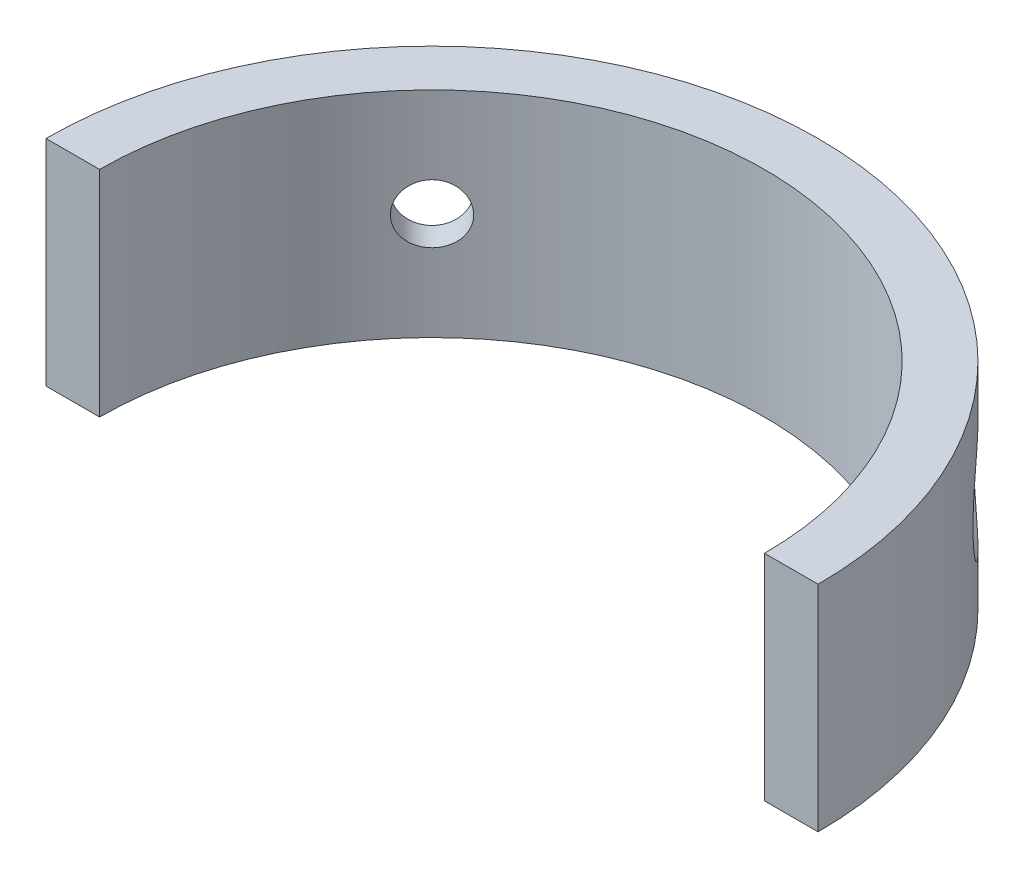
ISO-10303-21;
HEADER;
FILE_DESCRIPTION(('STEP AP214'),'2;1');
FILE_NAME('part.step','',(''),(''),'','','');
FILE_SCHEMA(('AUTOMOTIVE_DESIGN { 1 0 10303 214 1 1 1 1 }'));
ENDSEC;
DATA;
#1=APPLICATION_CONTEXT('core data for automotive mechanical design processes');
#2=APPLICATION_PROTOCOL_DEFINITION('international standard','automotive_design',2000,#1);
#3=PRODUCT_CONTEXT('',#1,'mechanical');
#4=PRODUCT('Part','Part','',(#3));
#5=PRODUCT_RELATED_PRODUCT_CATEGORY('part','',(#4));
#6=PRODUCT_DEFINITION_FORMATION('','',#4);
#7=PRODUCT_DEFINITION_CONTEXT('part definition',#1,'design');
#8=PRODUCT_DEFINITION('design','',#6,#7);
#9=PRODUCT_DEFINITION_SHAPE('','',#8);
#10=(LENGTH_UNIT() NAMED_UNIT(*) SI_UNIT(.MILLI.,.METRE.));
#11=(NAMED_UNIT(*) PLANE_ANGLE_UNIT() SI_UNIT($,.RADIAN.));
#12=(NAMED_UNIT(*) SI_UNIT($,.STERADIAN.) SOLID_ANGLE_UNIT());
#13=UNCERTAINTY_MEASURE_WITH_UNIT(LENGTH_MEASURE(1.E-05),#10,'distance_accuracy_value','');
#14=(GEOMETRIC_REPRESENTATION_CONTEXT(3) GLOBAL_UNCERTAINTY_ASSIGNED_CONTEXT((#13)) GLOBAL_UNIT_ASSIGNED_CONTEXT((#10,
#11,#12)) REPRESENTATION_CONTEXT('',''));
#15=CARTESIAN_POINT('',(0.,0.,0.));
#16=DIRECTION('',(0.,0.,1.));
#17=DIRECTION('',(1.,0.,0.));
#18=AXIS2_PLACEMENT_3D('',#15,#16,#17);
#19=CARTESIAN_POINT('',(0.,20.,0.));
#20=DIRECTION('',(0.,-1.,0.));
#21=DIRECTION('',(0.,0.,-1.));
#22=AXIS2_PLACEMENT_3D('',#19,#20,#21);
#23=CYLINDRICAL_SURFACE('',#22,31.);
#24=CARTESIAN_POINT('',(19.8893462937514,10.,-23.7784335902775));
#25=CARTESIAN_POINT('',(19.8893521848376,10.1541422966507,-23.778429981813));
#26=CARTESIAN_POINT('',(19.8993661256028,10.3083886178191,-23.7700636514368));
#27=CARTESIAN_POINT('',(19.939097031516,10.6126108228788,-23.736744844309));
#28=CARTESIAN_POINT('',(19.9688361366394,10.7625817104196,-23.711773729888));
#29=CARTESIAN_POINT('',(20.0469462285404,11.0538030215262,-23.645772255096));
#30=CARTESIAN_POINT('',(20.0953064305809,11.1950584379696,-23.6047511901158));
#31=CARTESIAN_POINT('',(20.2089574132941,11.46492316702,-23.5075223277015));
#32=CARTESIAN_POINT('',(20.274244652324,11.5935351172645,-23.4513177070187));
#33=CARTESIAN_POINT('',(20.4197177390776,11.8348665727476,-23.324759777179));
#34=CARTESIAN_POINT('',(20.4999413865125,11.9475444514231,-23.254370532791));
#35=CARTESIAN_POINT('',(20.6725087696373,12.1534513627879,-23.1010967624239));
#36=CARTESIAN_POINT('',(20.7648530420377,12.2466795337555,-23.0182116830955));
#37=CARTESIAN_POINT('',(20.9588279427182,12.4111810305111,-22.8417321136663));
#38=CARTESIAN_POINT('',(21.0604735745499,12.482418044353,-22.7481202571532));
#39=CARTESIAN_POINT('',(21.2697044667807,12.6006827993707,-22.5526085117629));
#40=CARTESIAN_POINT('',(21.3772896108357,12.6477110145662,-22.4507087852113));
#41=CARTESIAN_POINT('',(21.5948048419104,12.7161025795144,-22.2415623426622));
#42=CARTESIAN_POINT('',(21.7047279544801,12.7375336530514,-22.1343305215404));
#43=CARTESIAN_POINT('',(21.9239451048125,12.7543320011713,-21.9172175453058));
#44=CARTESIAN_POINT('',(22.0332391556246,12.7496998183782,-21.8073364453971));
#45=CARTESIAN_POINT('',(22.2477989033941,12.7145584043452,-21.5883968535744));
#46=CARTESIAN_POINT('',(22.3530750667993,12.6841219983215,-21.4793369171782));
#47=CARTESIAN_POINT('',(22.5571030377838,12.5983494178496,-21.2649715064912));
#48=CARTESIAN_POINT('',(22.6558547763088,12.5430129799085,-21.1596660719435));
#49=CARTESIAN_POINT('',(22.8444618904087,12.4089303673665,-20.9559032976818));
#50=CARTESIAN_POINT('',(22.9343046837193,12.3301516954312,-20.8574557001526));
#51=CARTESIAN_POINT('',(23.102782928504,12.1514444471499,-20.6706861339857));
#52=CARTESIAN_POINT('',(23.1814181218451,12.0515153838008,-20.5823643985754));
#53=CARTESIAN_POINT('',(23.3259371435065,11.8329337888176,-20.4184393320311));
#54=CARTESIAN_POINT('',(23.391776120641,11.7142179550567,-20.3428808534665));
#55=CARTESIAN_POINT('',(23.5089135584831,11.4616529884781,-20.2074003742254));
#56=CARTESIAN_POINT('',(23.5602120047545,11.3278038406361,-20.1474783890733));
#57=CARTESIAN_POINT('',(23.6471760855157,11.0487259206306,-20.0453382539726));
#58=CARTESIAN_POINT('',(23.682839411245,10.9034954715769,-20.0031227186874));
#59=CARTESIAN_POINT('',(23.737768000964,10.6057996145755,-19.937908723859));
#60=CARTESIAN_POINT('',(23.7570336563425,10.4533343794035,-19.9149098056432));
#61=CARTESIAN_POINT('',(23.7787269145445,10.1460524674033,-19.8890029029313));
#62=CARTESIAN_POINT('',(23.7812116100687,9.99124556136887,-19.8860267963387));
#63=CARTESIAN_POINT('',(23.769442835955,9.68318672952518,-19.900092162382));
#64=CARTESIAN_POINT('',(23.7551895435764,9.52993478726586,-19.9171334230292));
#65=CARTESIAN_POINT('',(23.7102791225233,9.22959150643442,-19.970575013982));
#66=CARTESIAN_POINT('',(23.6796489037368,9.08249048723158,-20.0069435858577));
#67=CARTESIAN_POINT('',(23.6026401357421,8.79832452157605,-20.0977337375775));
#68=CARTESIAN_POINT('',(23.5562613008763,8.66125975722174,-20.1521556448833));
#69=CARTESIAN_POINT('',(23.4485882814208,8.40065238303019,-20.2773399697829));
#70=CARTESIAN_POINT('',(23.3872543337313,8.27714711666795,-20.3481459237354));
#71=CARTESIAN_POINT('',(23.2510666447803,8.0475424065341,-20.5036229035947));
#72=CARTESIAN_POINT('',(23.1762126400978,7.94144330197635,-20.5882941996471));
#73=CARTESIAN_POINT('',(23.014441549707,7.74935951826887,-20.7689719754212));
#74=CARTESIAN_POINT('',(22.9274910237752,7.66343243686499,-20.8650097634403));
#75=CARTESIAN_POINT('',(22.7437576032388,7.51452739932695,-21.065135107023));
#76=CARTESIAN_POINT('',(22.646974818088,7.45154918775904,-21.1692225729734));
#77=CARTESIAN_POINT('',(22.4461562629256,7.35042812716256,-21.382035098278));
#78=CARTESIAN_POINT('',(22.342131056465,7.31224991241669,-21.4907533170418));
#79=CARTESIAN_POINT('',(22.1294714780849,7.26169704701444,-21.7096699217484));
#80=CARTESIAN_POINT('',(22.0208372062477,7.24932183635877,-21.8198682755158));
#81=CARTESIAN_POINT('',(21.8023783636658,7.25073319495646,-22.0381501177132));
#82=CARTESIAN_POINT('',(21.6925591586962,7.26443010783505,-22.1462395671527));
#83=CARTESIAN_POINT('',(21.4745572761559,7.31740962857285,-22.3576935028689));
#84=CARTESIAN_POINT('',(21.3663746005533,7.35669226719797,-22.4610579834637));
#85=CARTESIAN_POINT('',(21.1549158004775,7.45970471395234,-22.6603323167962));
#86=CARTESIAN_POINT('',(21.0516392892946,7.52343259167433,-22.7562427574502));
#87=CARTESIAN_POINT('',(20.8531920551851,7.6735165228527,-22.938232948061));
#88=CARTESIAN_POINT('',(20.7580212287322,7.75987228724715,-23.0243128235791));
#89=CARTESIAN_POINT('',(20.5785244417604,7.95309736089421,-23.1848853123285));
#90=CARTESIAN_POINT('',(20.4942351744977,8.06003319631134,-23.2593388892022));
#91=CARTESIAN_POINT('',(20.3396337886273,8.29125841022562,-23.3946549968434));
#92=CARTESIAN_POINT('',(20.2693250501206,8.4155519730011,-23.4555142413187));
#93=CARTESIAN_POINT('',(20.1449692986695,8.6782368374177,-23.5624058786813));
#94=CARTESIAN_POINT('',(20.0909562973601,8.81665682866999,-23.6084072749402));
#95=CARTESIAN_POINT('',(20.0013287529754,9.10336443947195,-23.6843900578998));
#96=CARTESIAN_POINT('',(19.9656931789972,9.25164055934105,-23.7143897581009));
#97=CARTESIAN_POINT('',(19.9230971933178,9.50065086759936,-23.7501715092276));
#98=CARTESIAN_POINT('',(19.910460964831,9.59978630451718,-23.7607589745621));
#99=CARTESIAN_POINT('',(19.8935836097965,9.79926645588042,-23.7748911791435));
#100=CARTESIAN_POINT('',(19.8893424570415,9.89961116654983,-23.7784359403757));
#101=CARTESIAN_POINT('',(19.8893462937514,10.,-23.7784335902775));
#102=B_SPLINE_CURVE_WITH_KNOTS('',3,(#24,#25,#26,#27,#28,#29,#30,#31,#32,#33,#34,#35,#36,#37,
#38,#39,#40,#41,#42,#43,#44,#45,#46,#47,#48,#49,#50,#51,#52,#53,#54,#55,#56,#57,#58,#59,#60,#61,
#62,#63,#64,#65,#66,#67,#68,#69,#70,#71,#72,#73,#74,#75,#76,#77,#78,#79,#80,#81,#82,#83,#84,#85,
#86,#87,#88,#89,#90,#91,#92,#93,#94,#95,#96,#97,#98,#99,#100,#101),.UNSPECIFIED.,.T.,.F.,(4,2,2,
2,2,2,2,2,2,2,2,2,2,2,2,2,2,2,2,2,2,2,2,2,2,2,2,2,2,2,2,2,2,2,2,2,2,2,4),(0.,0.46206033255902,
0.924640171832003,1.3869525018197,1.84916818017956,2.31256989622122,2.77599213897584,
3.24017554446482,3.70434986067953,4.16729334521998,4.63022719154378,5.09185886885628,
5.55349543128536,6.01577495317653,6.47806512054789,6.94194751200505,7.40583036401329,
7.86978169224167,8.33372194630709,8.79608296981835,9.2584390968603,9.7200378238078,
10.1816449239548,10.6444930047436,11.1073501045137,11.5715131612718,12.0356710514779,
12.49916557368,12.962650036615,13.4245435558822,13.8864376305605,14.348295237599,
14.8101469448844,15.2735174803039,15.7369999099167,16.2014431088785,16.6653536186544,
16.9662823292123,17.2672101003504),.UNSPECIFIED.);
#103=CARTESIAN_POINT('',(19.8893462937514,10.,-23.7784335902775));
#104=VERTEX_POINT('',#103);
#105=EDGE_CURVE('E38',#104,#104,#102,.T.);
#106=ORIENTED_EDGE('',*,*,#105,.T.);
#107=EDGE_LOOP('',(#106));
#108=FACE_BOUND('',#107,.T.);
#109=CARTESIAN_POINT('',(-23.7784335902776,10.,-19.8893462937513));
#110=CARTESIAN_POINT('',(-23.7784299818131,10.1541422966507,-19.8893521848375));
#111=CARTESIAN_POINT('',(-23.7700636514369,10.3083886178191,-19.8993661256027));
#112=CARTESIAN_POINT('',(-23.736744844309,10.6126108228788,-19.9390970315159));
#113=CARTESIAN_POINT('',(-23.7117737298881,10.7625817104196,-19.9688361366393));
#114=CARTESIAN_POINT('',(-23.645772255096,11.0538030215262,-20.0469462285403));
#115=CARTESIAN_POINT('',(-23.6047511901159,11.1950584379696,-20.0953064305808));
#116=CARTESIAN_POINT('',(-23.5075223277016,11.46492316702,-20.208957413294));
#117=CARTESIAN_POINT('',(-23.4513177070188,11.5935351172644,-20.274244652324));
#118=CARTESIAN_POINT('',(-23.324759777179,11.8348665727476,-20.4197177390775));
#119=CARTESIAN_POINT('',(-23.254370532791,11.9475444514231,-20.4999413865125));
#120=CARTESIAN_POINT('',(-23.101096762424,12.1534513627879,-20.6725087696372));
#121=CARTESIAN_POINT('',(-23.0182116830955,12.2466795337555,-20.7648530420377));
#122=CARTESIAN_POINT('',(-22.8417321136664,12.4111810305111,-20.9588279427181));
#123=CARTESIAN_POINT('',(-22.7481202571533,12.482418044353,-21.0604735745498));
#124=CARTESIAN_POINT('',(-22.552608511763,12.6006827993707,-21.2697044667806));
#125=CARTESIAN_POINT('',(-22.4507087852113,12.6477110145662,-21.3772896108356));
#126=CARTESIAN_POINT('',(-22.2415623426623,12.7161025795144,-21.5948048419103));
#127=CARTESIAN_POINT('',(-22.1343305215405,12.7375336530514,-21.70472795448));
#128=CARTESIAN_POINT('',(-21.9172175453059,12.7543320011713,-21.9239451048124));
#129=CARTESIAN_POINT('',(-21.8073364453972,12.7496998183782,-22.0332391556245));
#130=CARTESIAN_POINT('',(-21.5883968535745,12.7145584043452,-22.247798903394));
#131=CARTESIAN_POINT('',(-21.4793369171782,12.6841219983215,-22.3530750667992));
#132=CARTESIAN_POINT('',(-21.2649715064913,12.5983494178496,-22.5571030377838));
#133=CARTESIAN_POINT('',(-21.1596660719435,12.5430129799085,-22.6558547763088));
#134=CARTESIAN_POINT('',(-20.9559032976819,12.4089303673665,-22.8444618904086));
#135=CARTESIAN_POINT('',(-20.8574557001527,12.3301516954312,-22.9343046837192));
#136=CARTESIAN_POINT('',(-20.6706861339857,12.1514444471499,-23.1027829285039));
#137=CARTESIAN_POINT('',(-20.5823643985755,12.0515153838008,-23.181418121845));
#138=CARTESIAN_POINT('',(-20.4184393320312,11.8329337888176,-23.3259371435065));
#139=CARTESIAN_POINT('',(-20.3428808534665,11.7142179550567,-23.3917761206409));
#140=CARTESIAN_POINT('',(-20.2074003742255,11.4616529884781,-23.508913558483));
#141=CARTESIAN_POINT('',(-20.1474783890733,11.3278038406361,-23.5602120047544));
#142=CARTESIAN_POINT('',(-20.0453382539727,11.0487259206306,-23.6471760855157));
#143=CARTESIAN_POINT('',(-20.0031227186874,10.9034954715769,-23.682839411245));
#144=CARTESIAN_POINT('',(-19.9379087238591,10.6057996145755,-23.7377680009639));
#145=CARTESIAN_POINT('',(-19.9149098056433,10.4533343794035,-23.7570336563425));
#146=CARTESIAN_POINT('',(-19.8890029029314,10.1460524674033,-23.7787269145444));
#147=CARTESIAN_POINT('',(-19.8860267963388,9.99124556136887,-23.7812116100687));
#148=CARTESIAN_POINT('',(-19.9000921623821,9.68318672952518,-23.769442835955));
#149=CARTESIAN_POINT('',(-19.9171334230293,9.52993478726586,-23.7551895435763));
#150=CARTESIAN_POINT('',(-19.9705750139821,9.22959150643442,-23.7102791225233));
#151=CARTESIAN_POINT('',(-20.0069435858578,9.08249048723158,-23.6796489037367));
#152=CARTESIAN_POINT('',(-20.0977337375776,8.79832452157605,-23.6026401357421));
#153=CARTESIAN_POINT('',(-20.1521556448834,8.66125975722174,-23.5562613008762));
#154=CARTESIAN_POINT('',(-20.277339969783,8.40065238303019,-23.4485882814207));
#155=CARTESIAN_POINT('',(-20.3481459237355,8.27714711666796,-23.3872543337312));
#156=CARTESIAN_POINT('',(-20.5036229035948,8.0475424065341,-23.2510666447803));
#157=CARTESIAN_POINT('',(-20.5882941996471,7.94144330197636,-23.1762126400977));
#158=CARTESIAN_POINT('',(-20.7689719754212,7.74935951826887,-23.0144415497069));
#159=CARTESIAN_POINT('',(-20.8650097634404,7.66343243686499,-22.9274910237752));
#160=CARTESIAN_POINT('',(-21.0651351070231,7.51452739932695,-22.7437576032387));
#161=CARTESIAN_POINT('',(-21.1692225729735,7.45154918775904,-22.6469748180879));
#162=CARTESIAN_POINT('',(-21.3820350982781,7.35042812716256,-22.4461562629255));
#163=CARTESIAN_POINT('',(-21.4907533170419,7.31224991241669,-22.3421310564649));
#164=CARTESIAN_POINT('',(-21.7096699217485,7.26169704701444,-22.1294714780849));
#165=CARTESIAN_POINT('',(-21.8198682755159,7.24932183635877,-22.0208372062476));
#166=CARTESIAN_POINT('',(-22.0381501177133,7.25073319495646,-21.8023783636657));
#167=CARTESIAN_POINT('',(-22.1462395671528,7.26443010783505,-21.6925591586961));
#168=CARTESIAN_POINT('',(-22.3576935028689,7.31740962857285,-21.4745572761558));
#169=CARTESIAN_POINT('',(-22.4610579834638,7.35669226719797,-21.3663746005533));
#170=CARTESIAN_POINT('',(-22.6603323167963,7.45970471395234,-21.1549158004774));
#171=CARTESIAN_POINT('',(-22.7562427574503,7.52343259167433,-21.0516392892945));
#172=CARTESIAN_POINT('',(-22.9382329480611,7.6735165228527,-20.853192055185));
#173=CARTESIAN_POINT('',(-23.0243128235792,7.75987228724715,-20.7580212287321));
#174=CARTESIAN_POINT('',(-23.1848853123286,7.95309736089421,-20.5785244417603));
#175=CARTESIAN_POINT('',(-23.2593388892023,8.06003319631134,-20.4942351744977));
#176=CARTESIAN_POINT('',(-23.3946549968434,8.29125841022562,-20.3396337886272));
#177=CARTESIAN_POINT('',(-23.4555142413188,8.4155519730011,-20.2693250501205));
#178=CARTESIAN_POINT('',(-23.5624058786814,8.6782368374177,-20.1449692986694));
#179=CARTESIAN_POINT('',(-23.6084072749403,8.81665682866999,-20.09095629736));
#180=CARTESIAN_POINT('',(-23.6843900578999,9.10336443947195,-20.0013287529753));
#181=CARTESIAN_POINT('',(-23.714389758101,9.25164055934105,-19.9656931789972));
#182=CARTESIAN_POINT('',(-23.7501715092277,9.50065086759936,-19.9230971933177));
#183=CARTESIAN_POINT('',(-23.7607589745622,9.59978630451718,-19.9104609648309));
#184=CARTESIAN_POINT('',(-23.7748911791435,9.79926645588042,-19.8935836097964));
#185=CARTESIAN_POINT('',(-23.7784359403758,9.89961116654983,-19.8893424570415));
#186=CARTESIAN_POINT('',(-23.7784335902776,10.,-19.8893462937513));
#187=B_SPLINE_CURVE_WITH_KNOTS('',3,(#109,#110,#111,#112,#113,#114,#115,#116,#117,#118,#119,
#120,#121,#122,#123,#124,#125,#126,#127,#128,#129,#130,#131,#132,#133,#134,#135,#136,#137,#138,
#139,#140,#141,#142,#143,#144,#145,#146,#147,#148,#149,#150,#151,#152,#153,#154,#155,#156,#157,
#158,#159,#160,#161,#162,#163,#164,#165,#166,#167,#168,#169,#170,#171,#172,#173,#174,#175,#176,
#177,#178,#179,#180,#181,#182,#183,#184,#185,#186),.UNSPECIFIED.,.T.,.F.,(4,2,2,2,2,2,2,2,2,2,2,
2,2,2,2,2,2,2,2,2,2,2,2,2,2,2,2,2,2,2,2,2,2,2,2,2,2,2,4),(0.,0.462060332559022,
0.924640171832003,1.38695250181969,1.84916818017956,2.31256989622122,2.77599213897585,
3.24017554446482,3.70434986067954,4.16729334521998,4.63022719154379,5.09185886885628,
5.55349543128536,6.01577495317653,6.47806512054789,6.94194751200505,7.40583036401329,
7.86978169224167,8.3337219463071,8.79608296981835,9.2584390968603,9.72003782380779,
10.1816449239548,10.6444930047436,11.1073501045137,11.5715131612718,12.0356710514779,
12.49916557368,12.962650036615,13.4245435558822,13.8864376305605,14.348295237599,
14.8101469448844,15.2735174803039,15.7369999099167,16.2014431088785,16.6653536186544,
16.9662823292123,17.2672101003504),.UNSPECIFIED.);
#188=CARTESIAN_POINT('',(-23.7784335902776,10.,-19.8893462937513));
#189=VERTEX_POINT('',#188);
#190=EDGE_CURVE('E109',#189,#189,#187,.T.);
#191=ORIENTED_EDGE('',*,*,#190,.T.);
#192=EDGE_LOOP('',(#191));
#193=FACE_BOUND('',#192,.T.);
#194=CARTESIAN_POINT('',(0.,0.,0.));
#195=DIRECTION('',(0.,-1.,0.));
#196=DIRECTION('',(0.,0.,1.));
#197=AXIS2_PLACEMENT_3D('',#194,#195,#196);
#198=CIRCLE('',#197,31.);
#199=CARTESIAN_POINT('',(-31.,0.,0.));
#200=VERTEX_POINT('',#199);
#201=CARTESIAN_POINT('',(31.,0.,0.));
#202=VERTEX_POINT('',#201);
#203=EDGE_CURVE('E106',#200,#202,#198,.T.);
#204=ORIENTED_EDGE('',*,*,#203,.T.);
#205=DIRECTION('',(0.,-1.,0.));
#206=VECTOR('',#205,1.);
#207=CARTESIAN_POINT('',(31.,20.,0.));
#208=LINE('',#207,#206);
#209=CARTESIAN_POINT('',(31.,20.,0.));
#210=VERTEX_POINT('',#209);
#211=EDGE_CURVE('E97',#210,#202,#208,.T.);
#212=ORIENTED_EDGE('',*,*,#211,.F.);
#213=CARTESIAN_POINT('',(0.,20.,0.));
#214=DIRECTION('',(0.,-1.,0.));
#215=DIRECTION('',(0.,0.,1.));
#216=AXIS2_PLACEMENT_3D('',#213,#214,#215);
#217=CIRCLE('',#216,31.);
#218=CARTESIAN_POINT('',(-31.,20.,0.));
#219=VERTEX_POINT('',#218);
#220=EDGE_CURVE('E91',#219,#210,#217,.T.);
#221=ORIENTED_EDGE('',*,*,#220,.F.);
#222=DIRECTION('',(0.,-1.,0.));
#223=VECTOR('',#222,1.);
#224=CARTESIAN_POINT('',(-31.,20.,0.));
#225=LINE('',#224,#223);
#226=EDGE_CURVE('E102',#219,#200,#225,.T.);
#227=ORIENTED_EDGE('',*,*,#226,.T.);
#228=EDGE_LOOP('',(#204,#212,#221,#227));
#229=FACE_BOUND('',#228,.T.);
#230=ADVANCED_FACE('F34',(#108,#193,#229),#23,.F.);
#231=CARTESIAN_POINT('',(31.,20.,0.));
#232=DIRECTION('',(0.,0.,-1.));
#233=DIRECTION('',(-1.,0.,0.));
#234=AXIS2_PLACEMENT_3D('',#231,#232,#233);
#235=PLANE('',#234);
#236=DIRECTION('',(1.,0.,0.));
#237=VECTOR('',#236,1.);
#238=CARTESIAN_POINT('',(31.,0.,0.));
#239=LINE('',#238,#237);
#240=CARTESIAN_POINT('',(36.,0.,0.));
#241=VERTEX_POINT('',#240);
#242=EDGE_CURVE('E96',#202,#241,#239,.T.);
#243=ORIENTED_EDGE('',*,*,#242,.T.);
#244=DIRECTION('',(0.,-1.,0.));
#245=VECTOR('',#244,1.);
#246=CARTESIAN_POINT('',(36.,20.,0.));
#247=LINE('',#246,#245);
#248=CARTESIAN_POINT('',(36.,20.,0.));
#249=VERTEX_POINT('',#248);
#250=EDGE_CURVE('E94',#249,#241,#247,.T.);
#251=ORIENTED_EDGE('',*,*,#250,.F.);
#252=DIRECTION('',(1.,0.,0.));
#253=VECTOR('',#252,1.);
#254=CARTESIAN_POINT('',(31.,20.,0.));
#255=LINE('',#254,#253);
#256=EDGE_CURVE('E86',#210,#249,#255,.T.);
#257=ORIENTED_EDGE('',*,*,#256,.F.);
#258=ORIENTED_EDGE('',*,*,#211,.T.);
#259=EDGE_LOOP('',(#243,#251,#257,#258));
#260=FACE_BOUND('',#259,.T.);
#261=ADVANCED_FACE('F95',(#260),#235,.F.);
#262=CARTESIAN_POINT('',(0.,20.,0.));
#263=DIRECTION('',(0.,-1.,0.));
#264=DIRECTION('',(0.,0.,-1.));
#265=AXIS2_PLACEMENT_3D('',#262,#263,#264);
#266=CYLINDRICAL_SURFACE('',#265,36.);
#267=CARTESIAN_POINT('',(23.1420194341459,6.02445093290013,-27.5762023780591));
#268=CARTESIAN_POINT('',(23.2852155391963,5.85684145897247,-27.4560305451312));
#269=CARTESIAN_POINT('',(23.4371563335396,5.70327701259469,-27.3266160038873));
#270=CARTESIAN_POINT('',(23.7547794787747,5.4287049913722,-27.0509638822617));
#271=CARTESIAN_POINT('',(23.9204662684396,5.30770798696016,-26.9047208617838));
#272=CARTESIAN_POINT('',(24.2758945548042,5.09347135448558,-26.5846348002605));
#273=CARTESIAN_POINT('',(24.4664780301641,5.00352789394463,-26.4094990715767));
#274=CARTESIAN_POINT('',(24.8522426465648,4.87087087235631,-26.0468045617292));
#275=CARTESIAN_POINT('',(25.0474232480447,4.82815179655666,-25.8592472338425));
#276=CARTESIAN_POINT('',(25.4251142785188,4.79289831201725,-25.4878380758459));
#277=CARTESIAN_POINT('',(25.6077348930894,4.79775253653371,-25.3043425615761));
#278=CARTESIAN_POINT('',(25.9657974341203,4.85120099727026,-24.9367836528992));
#279=CARTESIAN_POINT('',(26.141240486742,4.89978834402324,-24.7527203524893));
#280=CARTESIAN_POINT('',(26.4780120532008,5.03771342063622,-24.3921091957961));
#281=CARTESIAN_POINT('',(26.6395008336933,5.12648453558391,-24.2154929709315));
#282=CARTESIAN_POINT('',(26.9475538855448,5.34126329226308,-23.872214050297));
#283=CARTESIAN_POINT('',(27.0941159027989,5.4672765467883,-23.7055528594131));
#284=CARTESIAN_POINT('',(27.3751697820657,5.7578819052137,-23.3805065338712));
#285=CARTESIAN_POINT('',(27.5089680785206,5.92378680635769,-23.2226975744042));
#286=CARTESIAN_POINT('',(27.7558755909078,6.28595136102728,-22.927026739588));
#287=CARTESIAN_POINT('',(27.8689790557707,6.48221942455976,-22.7891704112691));
#288=CARTESIAN_POINT('',(28.0800010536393,6.91321657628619,-22.5287261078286));
#289=CARTESIAN_POINT('',(28.1764526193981,7.14961730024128,-22.4077153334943));
#290=CARTESIAN_POINT('',(28.3437938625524,7.64392126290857,-22.1956672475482));
#291=CARTESIAN_POINT('',(28.414676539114,7.90183036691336,-22.1046381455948));
#292=CARTESIAN_POINT('',(28.5337530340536,8.44760002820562,-21.9507407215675));
#293=CARTESIAN_POINT('',(28.5804251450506,8.73632983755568,-21.88977099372));
#294=CARTESIAN_POINT('',(28.6444912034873,9.32244274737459,-21.8058689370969));
#295=CARTESIAN_POINT('',(28.6618798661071,9.61982739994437,-21.7829434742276));
#296=CARTESIAN_POINT('',(28.6673740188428,10.2242513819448,-21.7757141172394));
#297=CARTESIAN_POINT('',(28.6545900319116,10.5313139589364,-21.7925833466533));
#298=CARTESIAN_POINT('',(28.5979277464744,11.1375968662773,-21.866885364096));
#299=CARTESIAN_POINT('',(28.5540467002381,11.4368165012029,-21.9243217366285));
#300=CARTESIAN_POINT('',(28.4352909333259,12.0193694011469,-22.0781258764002));
#301=CARTESIAN_POINT('',(28.3603527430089,12.3026687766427,-22.174573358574));
#302=CARTESIAN_POINT('',(28.1799716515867,12.8440109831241,-22.4033552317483));
#303=CARTESIAN_POINT('',(28.0745304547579,13.1020552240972,-22.5356876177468));
#304=CARTESIAN_POINT('',(27.8374148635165,13.5776482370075,-22.8278925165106));
#305=CARTESIAN_POINT('',(27.706524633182,13.7961014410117,-22.9869260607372));
#306=CARTESIAN_POINT('',(27.4185910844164,14.1928288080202,-23.3296111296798));
#307=CARTESIAN_POINT('',(27.2615576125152,14.3711180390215,-23.5132533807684));
#308=CARTESIAN_POINT('',(26.9342820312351,14.6709718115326,-23.8872866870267));
#309=CARTESIAN_POINT('',(26.7653548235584,14.7952500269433,-24.0766501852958));
#310=CARTESIAN_POINT('',(26.4109462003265,14.9962181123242,-24.4648888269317));
#311=CARTESIAN_POINT('',(26.2254732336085,15.0729321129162,-24.6637590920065));
#312=CARTESIAN_POINT('',(25.8561993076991,15.1717448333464,-25.0504212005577));
#313=CARTESIAN_POINT('',(25.6731224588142,15.1971651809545,-25.2380601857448));
#314=CARTESIAN_POINT('',(25.3025652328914,15.2023835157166,-25.6095480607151));
#315=CARTESIAN_POINT('',(25.1150858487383,15.1821916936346,-25.7933977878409));
#316=CARTESIAN_POINT('',(24.7475534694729,15.0984671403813,-26.1461561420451));
#317=CARTESIAN_POINT('',(24.5674547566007,15.0363414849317,-26.315354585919));
#318=CARTESIAN_POINT('',(24.2138693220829,14.8726689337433,-26.6410654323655));
#319=CARTESIAN_POINT('',(24.04038307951,14.7711191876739,-26.7975769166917));
#320=CARTESIAN_POINT('',(23.7010107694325,14.5294630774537,-27.0982424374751));
#321=CARTESIAN_POINT('',(23.5353968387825,14.388511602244,-27.2420224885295));
#322=CARTESIAN_POINT('',(23.2208004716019,14.0738822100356,-27.5106761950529));
#323=CARTESIAN_POINT('',(23.0718221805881,13.9001961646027,-27.6355451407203));
#324=CARTESIAN_POINT('',(22.7859583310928,13.5138624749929,-27.8717885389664));
#325=CARTESIAN_POINT('',(22.6503477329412,13.2994945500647,-27.9818913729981));
#326=CARTESIAN_POINT('',(22.4058507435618,12.8459660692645,-28.1780496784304));
#327=CARTESIAN_POINT('',(22.2969721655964,12.6067982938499,-28.2640981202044));
#328=CARTESIAN_POINT('',(22.1028782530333,12.0943167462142,-28.4161748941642));
#329=CARTESIAN_POINT('',(22.0195787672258,11.819801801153,-28.4806062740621));
#330=CARTESIAN_POINT('',(21.8888023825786,11.2573956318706,-28.5812379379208));
#331=CARTESIAN_POINT('',(21.8413323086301,10.9695018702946,-28.6174328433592));
#332=CARTESIAN_POINT('',(21.7824435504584,10.3763717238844,-28.6622859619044));
#333=CARTESIAN_POINT('',(21.7725200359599,10.0708990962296,-28.6698022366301));
#334=CARTESIAN_POINT('',(21.7931806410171,9.46204972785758,-28.6540996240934));
#335=CARTESIAN_POINT('',(21.8237752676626,9.15867355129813,-28.630872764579));
#336=CARTESIAN_POINT('',(21.9251029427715,8.55921038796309,-28.5533528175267));
#337=CARTESIAN_POINT('',(21.9962815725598,8.26324304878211,-28.4987148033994));
#338=CARTESIAN_POINT('',(22.1768513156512,7.69106018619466,-28.3584248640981));
#339=CARTESIAN_POINT('',(22.286217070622,7.41483170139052,-28.2727935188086));
#340=CARTESIAN_POINT('',(22.5139834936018,6.94369716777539,-28.0915848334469));
#341=CARTESIAN_POINT('',(22.6261285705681,6.74361707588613,-28.0014838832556));
#342=CARTESIAN_POINT('',(22.8700687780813,6.36602958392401,-27.8026022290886));
#343=CARTESIAN_POINT('',(23.0018549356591,6.18851194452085,-27.6938300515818));
#344=CARTESIAN_POINT('',(23.1420194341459,6.02445093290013,-27.5762023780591));
#345=B_SPLINE_CURVE_WITH_KNOTS('',3,(#267,#268,#269,#270,#271,#272,#273,#274,#275,#276,#277,
#278,#279,#280,#281,#282,#283,#284,#285,#286,#287,#288,#289,#290,#291,#292,#293,#294,#295,#296,
#297,#298,#299,#300,#301,#302,#303,#304,#305,#306,#307,#308,#309,#310,#311,#312,#313,#314,#315,
#316,#317,#318,#319,#320,#321,#322,#323,#324,#325,#326,#327,#328,#329,#330,#331,#332,#333,#334,
#335,#336,#337,#338,#339,#340,#341,#342,#343,#344),.UNSPECIFIED.,.T.,.F.,(4,2,2,2,2,2,2,2,2,2,2,
2,2,2,2,2,2,2,2,2,2,2,2,2,2,2,2,2,2,2,2,2,2,2,2,2,2,2,4),(0.,0.752517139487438,1.50527823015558,
2.32299575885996,3.14061778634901,3.9136221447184,4.68650474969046,5.44881327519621,
6.21123674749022,7.00339177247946,7.79576660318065,8.63970104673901,9.48386638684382,
10.3760982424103,11.2684911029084,12.1875183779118,13.106626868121,14.0276230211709,
14.9485677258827,15.8446757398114,16.7404470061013,17.5836799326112,18.426484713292,
19.2126927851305,19.9987252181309,20.7596135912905,21.5205569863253,22.2992724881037,
23.0781816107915,23.9041643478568,24.7303882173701,25.6085077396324,26.4867944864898,
27.3997090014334,28.3128602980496,29.236235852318,30.1589993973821,30.8959206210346,
31.632506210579),.UNSPECIFIED.);
#346=CARTESIAN_POINT('',(23.1420194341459,6.02445093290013,-27.5762023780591));
#347=VERTEX_POINT('',#346);
#348=EDGE_CURVE('E11',#347,#347,#345,.T.);
#349=ORIENTED_EDGE('',*,*,#348,.T.);
#350=EDGE_LOOP('',(#349));
#351=FACE_BOUND('',#350,.T.);
#352=CARTESIAN_POINT('',(-25.4558441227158,4.80000000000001,-25.4558441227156));
#353=CARTESIAN_POINT('',(-25.2729571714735,4.80001755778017,-25.6387247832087));
#354=CARTESIAN_POINT('',(-25.0879556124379,4.82218637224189,-25.8197472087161));
#355=CARTESIAN_POINT('',(-24.7194611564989,4.90999587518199,-26.1727641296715));
#356=CARTESIAN_POINT('',(-24.5359700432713,4.97568208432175,-26.3447489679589));
#357=CARTESIAN_POINT('',(-24.1786820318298,5.14667274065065,-26.6730092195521));
#358=CARTESIAN_POINT('',(-24.0047869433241,5.25142369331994,-26.8294671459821));
#359=CARTESIAN_POINT('',(-23.6690147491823,5.49679196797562,-27.1261500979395));
#360=CARTESIAN_POINT('',(-23.5071368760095,5.63740699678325,-27.2663761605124));
#361=CARTESIAN_POINT('',(-23.1923946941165,5.957400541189,-27.5346625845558));
#362=CARTESIAN_POINT('',(-23.0403187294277,6.13829780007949,-27.6618339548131));
#363=CARTESIAN_POINT('',(-22.7581537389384,6.52890267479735,-27.8944430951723));
#364=CARTESIAN_POINT('',(-22.6280718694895,6.73861962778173,-27.9998737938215));
#365=CARTESIAN_POINT('',(-22.3854930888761,7.19574320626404,-28.1942458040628));
#366=CARTESIAN_POINT('',(-22.2747210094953,7.4447231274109,-28.2816416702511));
#367=CARTESIAN_POINT('',(-22.0850518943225,7.96194751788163,-28.430002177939));
#368=CARTESIAN_POINT('',(-22.0061630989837,8.23019694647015,-28.4909599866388));
#369=CARTESIAN_POINT('',(-21.8791916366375,8.79338504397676,-28.5885955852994));
#370=CARTESIAN_POINT('',(-21.8329342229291,9.08898587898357,-28.623838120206));
#371=CARTESIAN_POINT('',(-21.7795142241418,9.68573046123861,-28.6645057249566));
#372=CARTESIAN_POINT('',(-21.7723577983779,9.98687507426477,-28.6699260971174));
#373=CARTESIAN_POINT('',(-21.7976682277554,10.5938086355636,-28.6506882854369));
#374=CARTESIAN_POINT('',(-21.8310895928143,10.8995357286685,-28.625305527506));
#375=CARTESIAN_POINT('',(-21.9381316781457,11.4996026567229,-28.5433508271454));
#376=CARTESIAN_POINT('',(-22.0117552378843,11.7939416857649,-28.4867766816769));
#377=CARTESIAN_POINT('',(-22.1965689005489,12.3615498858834,-28.343004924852));
#378=CARTESIAN_POINT('',(-22.3076302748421,12.6348873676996,-28.2559122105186));
#379=CARTESIAN_POINT('',(-22.5638517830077,13.1529527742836,-28.0517257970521));
#380=CARTESIAN_POINT('',(-22.7090082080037,13.3976838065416,-27.9346353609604));
#381=CARTESIAN_POINT('',(-23.0232052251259,13.8422947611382,-27.6761973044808));
#382=CARTESIAN_POINT('',(-23.1912799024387,14.0434049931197,-27.5357964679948));
#383=CARTESIAN_POINT('',(-23.5491444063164,14.4031721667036,-27.2303676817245));
#384=CARTESIAN_POINT('',(-23.7389247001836,14.5618476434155,-27.0653505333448));
#385=CARTESIAN_POINT('',(-24.1208202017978,14.8213390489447,-26.7254024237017));
#386=CARTESIAN_POINT('',(-24.3120248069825,14.9251850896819,-26.5517629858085));
#387=CARTESIAN_POINT('',(-24.7009371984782,15.0850290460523,-26.1903412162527));
#388=CARTESIAN_POINT('',(-24.8986418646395,15.1410495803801,-26.0025656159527));
#389=CARTESIAN_POINT('',(-25.2810679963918,15.2006785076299,-25.6307280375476));
#390=CARTESIAN_POINT('',(-25.4658172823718,15.2073870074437,-25.4471864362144));
#391=CARTESIAN_POINT('',(-25.8293970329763,15.1762908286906,-25.0780645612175));
#392=CARTESIAN_POINT('',(-26.0082284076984,15.1384930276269,-24.8924846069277));
#393=CARTESIAN_POINT('',(-26.3513839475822,15.0212622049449,-24.5288773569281));
#394=CARTESIAN_POINT('',(-26.5159343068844,14.9427227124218,-24.3507733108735));
#395=CARTESIAN_POINT('',(-26.8309491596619,14.7475609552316,-24.0032340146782));
#396=CARTESIAN_POINT('',(-26.9814119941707,14.6309342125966,-23.83379978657));
#397=CARTESIAN_POINT('',(-27.2702265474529,14.359162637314,-23.5028643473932));
#398=CARTESIAN_POINT('',(-27.4080088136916,14.2028654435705,-23.3418145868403));
#399=CARTESIAN_POINT('',(-27.6635643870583,13.8589771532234,-23.0383732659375));
#400=CARTESIAN_POINT('',(-27.7813323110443,13.6713776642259,-22.8959867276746));
#401=CARTESIAN_POINT('',(-28.0024078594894,13.2574269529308,-22.6251562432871));
#402=CARTESIAN_POINT('',(-28.1043150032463,13.0293677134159,-22.4981798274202));
#403=CARTESIAN_POINT('',(-28.2831411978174,12.5504208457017,-22.2729580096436));
#404=CARTESIAN_POINT('',(-28.360053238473,12.2995268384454,-22.1747206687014));
#405=CARTESIAN_POINT('',(-28.492220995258,11.7659931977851,-22.0046745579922));
#406=CARTESIAN_POINT('',(-28.5459156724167,11.4823529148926,-21.9347863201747));
#407=CARTESIAN_POINT('',(-28.6244097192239,10.9045316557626,-21.8322548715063));
#408=CARTESIAN_POINT('',(-28.6492034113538,10.6103486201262,-21.7996189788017));
#409=CARTESIAN_POINT('',(-28.6701211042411,10.0092579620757,-21.7721039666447));
#410=CARTESIAN_POINT('',(-28.6652541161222,9.7022548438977,-21.7785299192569));
#411=CARTESIAN_POINT('',(-28.6245352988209,9.09386570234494,-21.8320195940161));
#412=CARTESIAN_POINT('',(-28.5886804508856,8.79248022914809,-21.8790872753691));
#413=CARTESIAN_POINT('',(-28.4858735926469,8.20229019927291,-22.01277165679));
#414=CARTESIAN_POINT('',(-28.4187517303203,7.91356390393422,-22.0996043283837));
#415=CARTESIAN_POINT('',(-28.2537672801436,7.35920628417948,-22.3101422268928));
#416=CARTESIAN_POINT('',(-28.155906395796,7.09357368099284,-22.4338454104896));
#417=CARTESIAN_POINT('',(-27.9328947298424,6.59990137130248,-22.7108819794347));
#418=CARTESIAN_POINT('',(-27.8084233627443,6.37113756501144,-22.863468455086));
#419=CARTESIAN_POINT('',(-27.5324944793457,5.95214084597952,-23.1950032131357));
#420=CARTESIAN_POINT('',(-27.3810397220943,5.76190399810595,-23.3739487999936));
#421=CARTESIAN_POINT('',(-27.0626669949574,5.43687810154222,-23.7416857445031));
#422=CARTESIAN_POINT('',(-26.8970471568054,5.29962620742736,-23.9294039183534));
#423=CARTESIAN_POINT('',(-26.6354161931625,5.12933066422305,-24.2192416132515));
#424=CARTESIAN_POINT('',(-26.5460298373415,5.07850418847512,-24.317205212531));
#425=CARTESIAN_POINT('',(-26.3633836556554,4.98917952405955,-24.5150992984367));
#426=CARTESIAN_POINT('',(-26.2701251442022,4.95067718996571,-24.6150291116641));
#427=CARTESIAN_POINT('',(-26.0591856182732,4.87930581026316,-24.838425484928));
#428=CARTESIAN_POINT('',(-25.9407016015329,4.84961505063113,-24.962164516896));
#429=CARTESIAN_POINT('',(-25.7004105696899,4.80995673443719,-25.2094961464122));
#430=CARTESIAN_POINT('',(-25.578603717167,4.79998821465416,-25.3330887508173));
#431=CARTESIAN_POINT('',(-25.4558441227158,4.80000000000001,-25.4558441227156));
#432=B_SPLINE_CURVE_WITH_KNOTS('',3,(#352,#353,#354,#355,#356,#357,#358,#359,#360,#361,#362,
#363,#364,#365,#366,#367,#368,#369,#370,#371,#372,#373,#374,#375,#376,#377,#378,#379,#380,#381,
#382,#383,#384,#385,#386,#387,#388,#389,#390,#391,#392,#393,#394,#395,#396,#397,#398,#399,#400,
#401,#402,#403,#404,#405,#406,#407,#408,#409,#410,#411,#412,#413,#414,#415,#416,#417,#418,#419,
#420,#421,#422,#423,#424,#425,#426,#427,#428,#429,#430,#431),.UNSPECIFIED.,.T.,.F.,(4,2,2,2,2,2,
2,2,2,2,2,2,2,2,2,2,2,2,2,2,2,2,2,2,2,2,2,2,2,2,2,2,2,2,2,2,2,2,2,4),(0.,0.775278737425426,
1.55136972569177,2.31685832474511,3.0822979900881,3.88393774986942,4.68583784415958,
5.54060767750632,6.39559829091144,7.295267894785,8.19507921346,9.11647314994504,
10.0379321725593,10.9562545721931,11.8744771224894,12.7618601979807,13.6488550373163,
14.4796232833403,15.3099984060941,16.0876845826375,16.865250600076,17.626442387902,
18.3877237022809,19.1743317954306,19.9611511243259,20.7981307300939,21.6353448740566,
22.5223786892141,23.4095867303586,24.3265960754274,25.2436947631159,26.1658345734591,
27.0879232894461,27.9888045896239,28.8895938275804,29.7411344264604,30.1666904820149,
30.592103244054,31.1125206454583,31.632912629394),.UNSPECIFIED.);
#433=CARTESIAN_POINT('',(-25.4558441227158,4.80000000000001,-25.4558441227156));
#434=VERTEX_POINT('',#433);
#435=EDGE_CURVE('E47',#434,#434,#432,.T.);
#436=ORIENTED_EDGE('',*,*,#435,.T.);
#437=EDGE_LOOP('',(#436));
#438=FACE_BOUND('',#437,.T.);
#439=CARTESIAN_POINT('',(0.,0.,0.));
#440=DIRECTION('',(0.,1.,0.));
#441=DIRECTION('',(0.,0.,1.));
#442=AXIS2_PLACEMENT_3D('',#439,#440,#441);
#443=CIRCLE('',#442,36.);
#444=CARTESIAN_POINT('',(-36.,0.,0.));
#445=VERTEX_POINT('',#444);
#446=EDGE_CURVE('E72',#241,#445,#443,.T.);
#447=ORIENTED_EDGE('',*,*,#446,.T.);
#448=DIRECTION('',(0.,-1.,0.));
#449=VECTOR('',#448,1.);
#450=CARTESIAN_POINT('',(-36.,20.,0.));
#451=LINE('',#450,#449);
#452=CARTESIAN_POINT('',(-36.,20.,0.));
#453=VERTEX_POINT('',#452);
#454=EDGE_CURVE('E98',#453,#445,#451,.T.);
#455=ORIENTED_EDGE('',*,*,#454,.F.);
#456=CARTESIAN_POINT('',(0.,20.,0.));
#457=DIRECTION('',(0.,1.,0.));
#458=DIRECTION('',(0.,0.,1.));
#459=AXIS2_PLACEMENT_3D('',#456,#457,#458);
#460=CIRCLE('',#459,36.);
#461=EDGE_CURVE('E89',#249,#453,#460,.T.);
#462=ORIENTED_EDGE('',*,*,#461,.F.);
#463=ORIENTED_EDGE('',*,*,#250,.T.);
#464=EDGE_LOOP('',(#447,#455,#462,#463));
#465=FACE_BOUND('',#464,.T.);
#466=ADVANCED_FACE('F100',(#351,#438,#465),#266,.T.);
#467=CARTESIAN_POINT('',(-36.,20.,0.));
#468=DIRECTION('',(0.,0.,-1.));
#469=DIRECTION('',(-1.,0.,0.));
#470=AXIS2_PLACEMENT_3D('',#467,#468,#469);
#471=PLANE('',#470);
#472=DIRECTION('',(1.,0.,0.));
#473=VECTOR('',#472,1.);
#474=CARTESIAN_POINT('',(-36.,0.,0.));
#475=LINE('',#474,#473);
#476=EDGE_CURVE('E78',#445,#200,#475,.T.);
#477=ORIENTED_EDGE('',*,*,#476,.T.);
#478=ORIENTED_EDGE('',*,*,#226,.F.);
#479=DIRECTION('',(1.,0.,0.));
#480=VECTOR('',#479,1.);
#481=CARTESIAN_POINT('',(-36.,20.,0.));
#482=LINE('',#481,#480);
#483=EDGE_CURVE('E55',#453,#219,#482,.T.);
#484=ORIENTED_EDGE('',*,*,#483,.F.);
#485=ORIENTED_EDGE('',*,*,#454,.T.);
#486=EDGE_LOOP('',(#477,#478,#484,#485));
#487=FACE_BOUND('',#486,.T.);
#488=ADVANCED_FACE('F142',(#487),#471,.F.);
#489=CARTESIAN_POINT('',(0.,20.,0.));
#490=DIRECTION('',(0.,1.,0.));
#491=DIRECTION('',(0.,0.,1.));
#492=AXIS2_PLACEMENT_3D('',#489,#490,#491);
#493=PLANE('',#492);
#494=ORIENTED_EDGE('',*,*,#220,.T.);
#495=ORIENTED_EDGE('',*,*,#256,.T.);
#496=ORIENTED_EDGE('',*,*,#461,.T.);
#497=ORIENTED_EDGE('',*,*,#483,.T.);
#498=EDGE_LOOP('',(#494,#495,#496,#497));
#499=FACE_BOUND('',#498,.T.);
#500=ADVANCED_FACE('F87',(#499),#493,.T.);
#501=CARTESIAN_POINT('',(0.,0.,0.));
#502=DIRECTION('',(0.,1.,0.));
#503=DIRECTION('',(0.,0.,1.));
#504=AXIS2_PLACEMENT_3D('',#501,#502,#503);
#505=PLANE('',#504);
#506=ORIENTED_EDGE('',*,*,#203,.F.);
#507=ORIENTED_EDGE('',*,*,#476,.F.);
#508=ORIENTED_EDGE('',*,*,#446,.F.);
#509=ORIENTED_EDGE('',*,*,#242,.F.);
#510=EDGE_LOOP('',(#506,#507,#508,#509));
#511=FACE_BOUND('',#510,.T.);
#512=ADVANCED_FACE('F138',(#511),#505,.F.);
#513=CARTESIAN_POINT('',(-25.4558441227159,10.,-25.4558441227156));
#514=DIRECTION('',(-0.707106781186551,0.,-0.707106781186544));
#515=DIRECTION('',(-0.707106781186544,0.,0.707106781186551));
#516=AXIS2_PLACEMENT_3D('',#513,#514,#515);
#517=CYLINDRICAL_SURFACE('',#516,2.74999999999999);
#518=CARTESIAN_POINT('',(-23.7234325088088,10.,-23.7234325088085));
#519=DIRECTION('',(-0.707106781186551,0.,-0.707106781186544));
#520=DIRECTION('',(-0.707106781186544,0.,0.707106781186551));
#521=AXIS2_PLACEMENT_3D('',#518,#519,#520);
#522=CIRCLE('',#521,2.75);
#523=CARTESIAN_POINT('',(-25.6679761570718,10.,-21.7788888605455));
#524=VERTEX_POINT('',#523);
#525=EDGE_CURVE('E163',#524,#524,#522,.T.);
#526=ORIENTED_EDGE('',*,*,#525,.T.);
#527=EDGE_LOOP('',(#526));
#528=FACE_BOUND('',#527,.T.);
#529=ORIENTED_EDGE('',*,*,#190,.F.);
#530=EDGE_LOOP('',(#529));
#531=FACE_BOUND('',#530,.T.);
#532=ADVANCED_FACE('F131',(#528,#531),#517,.F.);
#533=CARTESIAN_POINT('',(-25.4558441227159,10.,-25.4558441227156));
#534=DIRECTION('',(-0.707106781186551,0.,-0.707106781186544));
#535=DIRECTION('',(-0.707106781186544,0.,0.707106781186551));
#536=AXIS2_PLACEMENT_3D('',#533,#534,#535);
#537=CONICAL_SURFACE('',#536,5.2,0.785398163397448);
#538=ORIENTED_EDGE('',*,*,#525,.F.);
#539=EDGE_LOOP('',(#538));
#540=FACE_BOUND('',#539,.T.);
#541=ORIENTED_EDGE('',*,*,#435,.F.);
#542=EDGE_LOOP('',(#541));
#543=FACE_BOUND('',#542,.T.);
#544=ADVANCED_FACE('F127',(#540,#543),#537,.F.);
#545=CARTESIAN_POINT('',(25.4558441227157,10.,-25.4558441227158));
#546=DIRECTION('',(0.707106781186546,0.,-0.707106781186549));
#547=DIRECTION('',(-0.707106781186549,0.,-0.707106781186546));
#548=AXIS2_PLACEMENT_3D('',#545,#546,#547);
#549=CYLINDRICAL_SURFACE('',#548,2.74999999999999);
#550=CARTESIAN_POINT('',(23.7234325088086,10.,-23.7234325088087));
#551=DIRECTION('',(0.707106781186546,0.,-0.707106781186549));
#552=DIRECTION('',(-0.707106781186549,0.,-0.707106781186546));
#553=AXIS2_PLACEMENT_3D('',#550,#551,#552);
#554=CIRCLE('',#553,2.75);
#555=CARTESIAN_POINT('',(21.7788888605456,10.,-25.6679761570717));
#556=VERTEX_POINT('',#555);
#557=EDGE_CURVE('E166',#556,#556,#554,.T.);
#558=ORIENTED_EDGE('',*,*,#557,.T.);
#559=EDGE_LOOP('',(#558));
#560=FACE_BOUND('',#559,.T.);
#561=ORIENTED_EDGE('',*,*,#105,.F.);
#562=EDGE_LOOP('',(#561));
#563=FACE_BOUND('',#562,.T.);
#564=ADVANCED_FACE('F130',(#560,#563),#549,.F.);
#565=CARTESIAN_POINT('',(25.4558441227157,10.,-25.4558441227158));
#566=DIRECTION('',(0.707106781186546,0.,-0.707106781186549));
#567=DIRECTION('',(-0.707106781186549,0.,-0.707106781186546));
#568=AXIS2_PLACEMENT_3D('',#565,#566,#567);
#569=CONICAL_SURFACE('',#568,5.2,0.785398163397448);
#570=ORIENTED_EDGE('',*,*,#557,.F.);
#571=EDGE_LOOP('',(#570));
#572=FACE_BOUND('',#571,.T.);
#573=ORIENTED_EDGE('',*,*,#348,.F.);
#574=EDGE_LOOP('',(#573));
#575=FACE_BOUND('',#574,.T.);
#576=ADVANCED_FACE('F172',(#572,#575),#569,.F.);
#577=CLOSED_SHELL('',(#230,#261,#466,#488,#500,#512,#532,#544,#564,#576));
#578=MANIFOLD_SOLID_BREP('B2',#577);
#579=ADVANCED_BREP_SHAPE_REPRESENTATION('',(#18,#578),#14);
#580=SHAPE_DEFINITION_REPRESENTATION(#9,#579);
ENDSEC;
END-ISO-10303-21;
